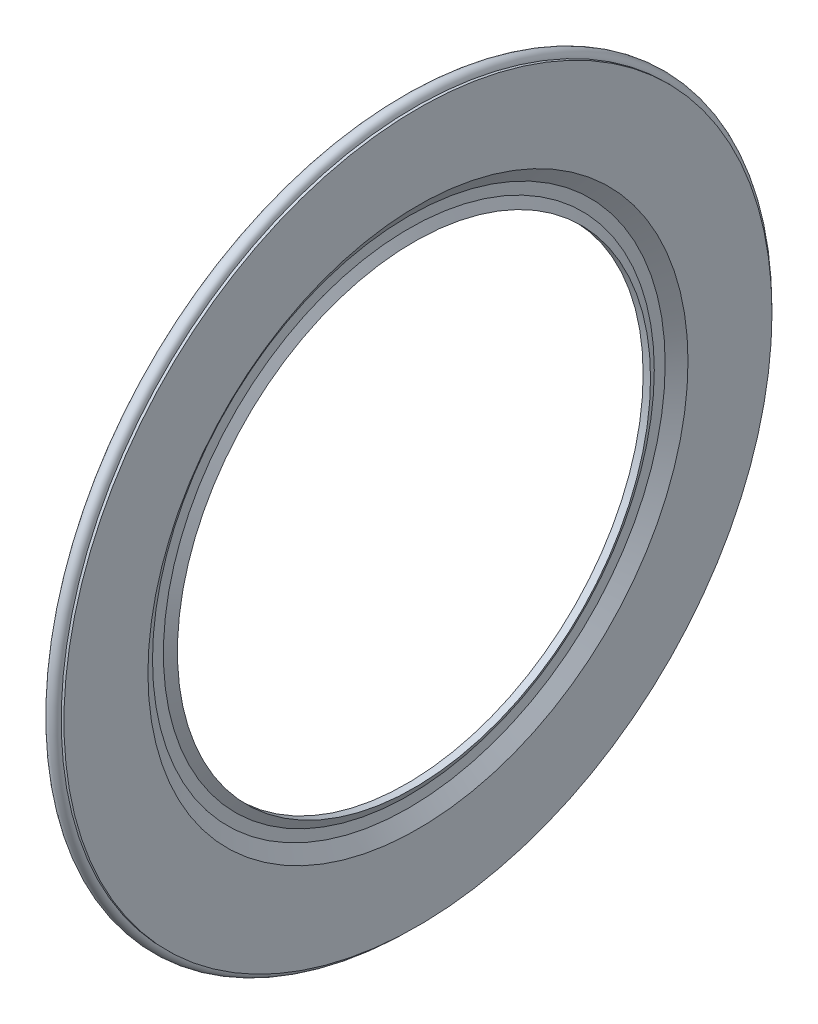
ISO-10303-21;
HEADER;
FILE_DESCRIPTION(('STEP AP214'),'2;1');
FILE_NAME('part.step','',(''),(''),'','','');
FILE_SCHEMA(('AUTOMOTIVE_DESIGN { 1 0 10303 214 1 1 1 1 }'));
ENDSEC;
DATA;
#1=APPLICATION_CONTEXT('core data for automotive mechanical design processes');
#2=APPLICATION_PROTOCOL_DEFINITION('international standard','automotive_design',2000,#1);
#3=PRODUCT_CONTEXT('',#1,'mechanical');
#4=PRODUCT('Part','Part','',(#3));
#5=PRODUCT_RELATED_PRODUCT_CATEGORY('part','',(#4));
#6=PRODUCT_DEFINITION_FORMATION('','',#4);
#7=PRODUCT_DEFINITION_CONTEXT('part definition',#1,'design');
#8=PRODUCT_DEFINITION('design','',#6,#7);
#9=PRODUCT_DEFINITION_SHAPE('','',#8);
#10=(LENGTH_UNIT() NAMED_UNIT(*) SI_UNIT(.MILLI.,.METRE.));
#11=(NAMED_UNIT(*) PLANE_ANGLE_UNIT() SI_UNIT($,.RADIAN.));
#12=(NAMED_UNIT(*) SI_UNIT($,.STERADIAN.) SOLID_ANGLE_UNIT());
#13=UNCERTAINTY_MEASURE_WITH_UNIT(LENGTH_MEASURE(1.E-05),#10,'distance_accuracy_value','');
#14=(GEOMETRIC_REPRESENTATION_CONTEXT(3) GLOBAL_UNCERTAINTY_ASSIGNED_CONTEXT((#13)) GLOBAL_UNIT_ASSIGNED_CONTEXT((#10,
#11,#12)) REPRESENTATION_CONTEXT('',''));
#15=CARTESIAN_POINT('',(0.,0.,0.));
#16=DIRECTION('',(0.,0.,1.));
#17=DIRECTION('',(1.,0.,0.));
#18=AXIS2_PLACEMENT_3D('',#15,#16,#17);
#19=CARTESIAN_POINT('',(6.41666666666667,0.,0.));
#20=DIRECTION('',(-1.,0.,0.));
#21=DIRECTION('',(0.,0.,1.));
#22=AXIS2_PLACEMENT_3D('',#19,#20,#21);
#23=CONICAL_SURFACE('',#22,8.90414518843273,1.0471975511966);
#24=CARTESIAN_POINT('',(6.56822111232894,0.,0.));
#25=DIRECTION('',(1.,0.,0.));
#26=DIRECTION('',(0.,0.,-1.));
#27=AXIS2_PLACEMENT_3D('',#24,#25,#26);
#28=CIRCLE('',#27,8.64164518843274);
#29=CARTESIAN_POINT('',(6.56822111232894,0.,-8.64164518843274));
#30=VERTEX_POINT('',#29);
#31=EDGE_CURVE('E75',#30,#30,#28,.T.);
#32=ORIENTED_EDGE('',*,*,#31,.T.);
#33=EDGE_LOOP('',(#32));
#34=FACE_BOUND('',#33,.T.);
#35=CARTESIAN_POINT('',(6.41666666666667,0.,0.));
#36=DIRECTION('',(1.,0.,0.));
#37=DIRECTION('',(0.,0.,-1.));
#38=AXIS2_PLACEMENT_3D('',#35,#36,#37);
#39=CIRCLE('',#38,8.90414518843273);
#40=CARTESIAN_POINT('',(6.41666666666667,0.,-8.90414518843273));
#41=VERTEX_POINT('',#40);
#42=EDGE_CURVE('E10',#41,#41,#39,.T.);
#43=ORIENTED_EDGE('',*,*,#42,.F.);
#44=EDGE_LOOP('',(#43));
#45=FACE_BOUND('',#44,.T.);
#46=ADVANCED_FACE('F14',(#34,#45),#23,.F.);
#47=CARTESIAN_POINT('',(6.41666666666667,9.7,0.));
#48=DIRECTION('',(-1.,0.,0.));
#49=DIRECTION('',(0.,0.,1.));
#50=AXIS2_PLACEMENT_3D('',#47,#48,#49);
#51=PLANE('',#50);
#52=ORIENTED_EDGE('',*,*,#42,.T.);
#53=EDGE_LOOP('',(#52));
#54=FACE_BOUND('',#53,.T.);
#55=CARTESIAN_POINT('',(6.41666666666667,0.,0.));
#56=DIRECTION('',(1.,0.,0.));
#57=DIRECTION('',(0.,0.,-1.));
#58=AXIS2_PLACEMENT_3D('',#55,#56,#57);
#59=CIRCLE('',#58,9.7);
#60=CARTESIAN_POINT('',(6.41666666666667,0.,-9.7));
#61=VERTEX_POINT('',#60);
#62=EDGE_CURVE('E21',#61,#61,#59,.T.);
#63=ORIENTED_EDGE('',*,*,#62,.F.);
#64=EDGE_LOOP('',(#63));
#65=FACE_BOUND('',#64,.T.);
#66=ADVANCED_FACE('F96',(#54,#65),#51,.T.);
#67=CARTESIAN_POINT('',(6.41666666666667,0.,0.));
#68=DIRECTION('',(1.,0.,0.));
#69=DIRECTION('',(0.,0.,-1.));
#70=AXIS2_PLACEMENT_3D('',#67,#68,#69);
#71=CONICAL_SURFACE('',#70,9.7,0.982793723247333);
#72=CARTESIAN_POINT('',(6.51666666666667,0.,0.));
#73=DIRECTION('',(1.,0.,0.));
#74=DIRECTION('',(0.,0.,-1.));
#75=AXIS2_PLACEMENT_3D('',#72,#73,#74);
#76=CIRCLE('',#75,9.85);
#77=CARTESIAN_POINT('',(6.51666666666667,0.,-9.85));
#78=VERTEX_POINT('',#77);
#79=EDGE_CURVE('E30',#78,#78,#76,.T.);
#80=ORIENTED_EDGE('',*,*,#79,.F.);
#81=EDGE_LOOP('',(#80));
#82=FACE_BOUND('',#81,.T.);
#83=ORIENTED_EDGE('',*,*,#62,.T.);
#84=EDGE_LOOP('',(#83));
#85=FACE_BOUND('',#84,.T.);
#86=ADVANCED_FACE('F100',(#82,#85),#71,.T.);
#87=CARTESIAN_POINT('',(6.51666666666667,9.85,0.));
#88=DIRECTION('',(1.,0.,0.));
#89=DIRECTION('',(0.,0.,-1.));
#90=AXIS2_PLACEMENT_3D('',#87,#88,#89);
#91=PLANE('',#90);
#92=CARTESIAN_POINT('',(6.51666666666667,0.,0.));
#93=DIRECTION('',(1.,0.,0.));
#94=DIRECTION('',(0.,0.,-1.));
#95=AXIS2_PLACEMENT_3D('',#92,#93,#94);
#96=CIRCLE('',#95,11.65);
#97=CARTESIAN_POINT('',(6.51666666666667,0.,-11.65));
#98=VERTEX_POINT('',#97);
#99=EDGE_CURVE('E37',#98,#98,#96,.T.);
#100=ORIENTED_EDGE('',*,*,#99,.F.);
#101=EDGE_LOOP('',(#100));
#102=FACE_BOUND('',#101,.T.);
#103=ORIENTED_EDGE('',*,*,#79,.T.);
#104=EDGE_LOOP('',(#103));
#105=FACE_BOUND('',#104,.T.);
#106=ADVANCED_FACE('F104',(#102,#105),#91,.F.);
#107=CARTESIAN_POINT('',(6.51666666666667,0.,0.));
#108=DIRECTION('',(-1.,0.,0.));
#109=DIRECTION('',(0.,0.,1.));
#110=AXIS2_PLACEMENT_3D('',#107,#108,#109);
#111=CONICAL_SURFACE('',#110,11.65,0.982793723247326);
#112=CARTESIAN_POINT('',(6.41666666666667,0.,0.));
#113=DIRECTION('',(1.,0.,0.));
#114=DIRECTION('',(0.,0.,-1.));
#115=AXIS2_PLACEMENT_3D('',#112,#113,#114);
#116=CIRCLE('',#115,11.8);
#117=CARTESIAN_POINT('',(6.41666666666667,0.,-11.8));
#118=VERTEX_POINT('',#117);
#119=EDGE_CURVE('E43',#118,#118,#116,.T.);
#120=ORIENTED_EDGE('',*,*,#119,.F.);
#121=EDGE_LOOP('',(#120));
#122=FACE_BOUND('',#121,.T.);
#123=ORIENTED_EDGE('',*,*,#99,.T.);
#124=EDGE_LOOP('',(#123));
#125=FACE_BOUND('',#124,.T.);
#126=ADVANCED_FACE('F111',(#122,#125),#111,.F.);
#127=CARTESIAN_POINT('',(6.41666666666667,12.9326424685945,0.));
#128=DIRECTION('',(-1.,0.,0.));
#129=DIRECTION('',(0.,0.,1.));
#130=AXIS2_PLACEMENT_3D('',#127,#128,#129);
#131=PLANE('',#130);
#132=ORIENTED_EDGE('',*,*,#119,.T.);
#133=EDGE_LOOP('',(#132));
#134=FACE_BOUND('',#133,.T.);
#135=CARTESIAN_POINT('',(6.41666666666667,0.,0.));
#136=DIRECTION('',(1.,0.,0.));
#137=DIRECTION('',(0.,0.,-1.));
#138=AXIS2_PLACEMENT_3D('',#135,#136,#137);
#139=CIRCLE('',#138,12.9326424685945);
#140=CARTESIAN_POINT('',(6.41666666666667,0.,-12.9326424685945));
#141=VERTEX_POINT('',#140);
#142=EDGE_CURVE('E47',#141,#141,#139,.T.);
#143=ORIENTED_EDGE('',*,*,#142,.F.);
#144=EDGE_LOOP('',(#143));
#145=FACE_BOUND('',#144,.T.);
#146=ADVANCED_FACE('F115',(#134,#145),#131,.T.);
#147=CARTESIAN_POINT('',(6.65,0.,0.));
#148=DIRECTION('',(1.,0.,0.));
#149=DIRECTION('',(0.,0.,-1.));
#150=AXIS2_PLACEMENT_3D('',#147,#148,#149);
#151=TOROIDAL_SURFACE('',#150,12.9326424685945,0.233333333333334);
#152=CARTESIAN_POINT('',(6.88333333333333,0.,0.));
#153=DIRECTION('',(1.,0.,0.));
#154=DIRECTION('',(0.,0.,-1.));
#155=AXIS2_PLACEMENT_3D('',#152,#153,#154);
#156=CIRCLE('',#155,12.9326424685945);
#157=CARTESIAN_POINT('',(6.88333333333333,0.,-12.9326424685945));
#158=VERTEX_POINT('',#157);
#159=EDGE_CURVE('E51',#158,#158,#156,.T.);
#160=ORIENTED_EDGE('',*,*,#159,.F.);
#161=EDGE_LOOP('',(#160));
#162=FACE_BOUND('',#161,.T.);
#163=ORIENTED_EDGE('',*,*,#142,.T.);
#164=EDGE_LOOP('',(#163));
#165=FACE_BOUND('',#164,.T.);
#166=ADVANCED_FACE('F119',(#162,#165),#151,.T.);
#167=CARTESIAN_POINT('',(7.,0.,0.));
#168=DIRECTION('',(1.,0.,0.));
#169=DIRECTION('',(0.,0.,-1.));
#170=AXIS2_PLACEMENT_3D('',#167,#168,#169);
#171=CYLINDRICAL_SURFACE('',#170,12.9326424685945);
#172=CARTESIAN_POINT('',(6.98333333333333,0.,0.));
#173=DIRECTION('',(1.,0.,0.));
#174=DIRECTION('',(0.,0.,-1.));
#175=AXIS2_PLACEMENT_3D('',#172,#173,#174);
#176=CIRCLE('',#175,12.9326424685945);
#177=CARTESIAN_POINT('',(6.98333333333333,0.,-12.9326424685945));
#178=VERTEX_POINT('',#177);
#179=EDGE_CURVE('E55',#178,#178,#176,.T.);
#180=ORIENTED_EDGE('',*,*,#179,.F.);
#181=EDGE_LOOP('',(#180));
#182=FACE_BOUND('',#181,.T.);
#183=ORIENTED_EDGE('',*,*,#159,.T.);
#184=EDGE_LOOP('',(#183));
#185=FACE_BOUND('',#184,.T.);
#186=ADVANCED_FACE('F123',(#182,#185),#171,.T.);
#187=CARTESIAN_POINT('',(6.98333333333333,12.9326424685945,0.));
#188=DIRECTION('',(-1.,0.,0.));
#189=DIRECTION('',(0.,0.,1.));
#190=AXIS2_PLACEMENT_3D('',#187,#188,#189);
#191=PLANE('',#190);
#192=CARTESIAN_POINT('',(6.98333333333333,0.,0.));
#193=DIRECTION('',(1.,0.,0.));
#194=DIRECTION('',(0.,0.,-1.));
#195=AXIS2_PLACEMENT_3D('',#192,#193,#194);
#196=CIRCLE('',#195,9.86459407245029);
#197=CARTESIAN_POINT('',(6.98333333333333,0.,-9.86459407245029));
#198=VERTEX_POINT('',#197);
#199=EDGE_CURVE('E59',#198,#198,#196,.T.);
#200=ORIENTED_EDGE('',*,*,#199,.F.);
#201=EDGE_LOOP('',(#200));
#202=FACE_BOUND('',#201,.T.);
#203=ORIENTED_EDGE('',*,*,#179,.T.);
#204=EDGE_LOOP('',(#203));
#205=FACE_BOUND('',#204,.T.);
#206=ADVANCED_FACE('F127',(#202,#205),#191,.F.);
#207=CARTESIAN_POINT('',(6.98333333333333,0.,0.));
#208=DIRECTION('',(1.,0.,0.));
#209=DIRECTION('',(0.,0.,-1.));
#210=AXIS2_PLACEMENT_3D('',#207,#208,#209);
#211=CONICAL_SURFACE('',#210,9.86459407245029,0.982793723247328);
#212=CARTESIAN_POINT('',(6.65,0.,0.));
#213=DIRECTION('',(1.,0.,0.));
#214=DIRECTION('',(0.,0.,-1.));
#215=AXIS2_PLACEMENT_3D('',#212,#213,#214);
#216=CIRCLE('',#215,9.3645940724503);
#217=CARTESIAN_POINT('',(6.65,0.,-9.3645940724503));
#218=VERTEX_POINT('',#217);
#219=EDGE_CURVE('E63',#218,#218,#216,.T.);
#220=ORIENTED_EDGE('',*,*,#219,.F.);
#221=EDGE_LOOP('',(#220));
#222=FACE_BOUND('',#221,.T.);
#223=ORIENTED_EDGE('',*,*,#199,.T.);
#224=EDGE_LOOP('',(#223));
#225=FACE_BOUND('',#224,.T.);
#226=ADVANCED_FACE('F131',(#222,#225),#211,.F.);
#227=CARTESIAN_POINT('',(6.65,8.96666666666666,0.));
#228=DIRECTION('',(1.,0.,0.));
#229=DIRECTION('',(0.,0.,-1.));
#230=AXIS2_PLACEMENT_3D('',#227,#228,#229);
#231=PLANE('',#230);
#232=ORIENTED_EDGE('',*,*,#219,.T.);
#233=EDGE_LOOP('',(#232));
#234=FACE_BOUND('',#233,.T.);
#235=CARTESIAN_POINT('',(6.65,0.,0.));
#236=DIRECTION('',(1.,0.,0.));
#237=DIRECTION('',(0.,0.,-1.));
#238=AXIS2_PLACEMENT_3D('',#235,#236,#237);
#239=CIRCLE('',#238,8.96666666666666);
#240=CARTESIAN_POINT('',(6.65,0.,-8.96666666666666));
#241=VERTEX_POINT('',#240);
#242=EDGE_CURVE('E67',#241,#241,#239,.T.);
#243=ORIENTED_EDGE('',*,*,#242,.F.);
#244=EDGE_LOOP('',(#243));
#245=FACE_BOUND('',#244,.T.);
#246=ADVANCED_FACE('F92',(#234,#245),#231,.T.);
#247=CARTESIAN_POINT('',(6.83765123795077,0.,0.));
#248=DIRECTION('',(-1.,0.,0.));
#249=DIRECTION('',(0.,0.,1.));
#250=AXIS2_PLACEMENT_3D('',#247,#248,#249);
#251=CONICAL_SURFACE('',#250,8.64164518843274,1.0471975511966);
#252=ORIENTED_EDGE('',*,*,#242,.T.);
#253=EDGE_LOOP('',(#252));
#254=FACE_BOUND('',#253,.T.);
#255=CARTESIAN_POINT('',(6.83765123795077,0.,0.));
#256=DIRECTION('',(1.,0.,0.));
#257=DIRECTION('',(0.,0.,-1.));
#258=AXIS2_PLACEMENT_3D('',#255,#256,#257);
#259=CIRCLE('',#258,8.64164518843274);
#260=CARTESIAN_POINT('',(6.83765123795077,0.,-8.64164518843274));
#261=VERTEX_POINT('',#260);
#262=EDGE_CURVE('E71',#261,#261,#259,.T.);
#263=ORIENTED_EDGE('',*,*,#262,.F.);
#264=EDGE_LOOP('',(#263));
#265=FACE_BOUND('',#264,.T.);
#266=ADVANCED_FACE('F85',(#254,#265),#251,.T.);
#267=CARTESIAN_POINT('',(7.,0.,0.));
#268=DIRECTION('',(1.,0.,0.));
#269=DIRECTION('',(0.,0.,-1.));
#270=AXIS2_PLACEMENT_3D('',#267,#268,#269);
#271=CYLINDRICAL_SURFACE('',#270,8.64164518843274);
#272=ORIENTED_EDGE('',*,*,#262,.T.);
#273=EDGE_LOOP('',(#272));
#274=FACE_BOUND('',#273,.T.);
#275=ORIENTED_EDGE('',*,*,#31,.F.);
#276=EDGE_LOOP('',(#275));
#277=FACE_BOUND('',#276,.T.);
#278=ADVANCED_FACE('F83',(#274,#277),#271,.F.);
#279=CLOSED_SHELL('',(#46,#66,#86,#106,#126,#146,#166,#186,#206,#226,#246,#266,#278));
#280=MANIFOLD_SOLID_BREP('B1',#279);
#281=ADVANCED_BREP_SHAPE_REPRESENTATION('',(#18,#280),#14);
#282=SHAPE_DEFINITION_REPRESENTATION(#9,#281);
ENDSEC;
END-ISO-10303-21;
